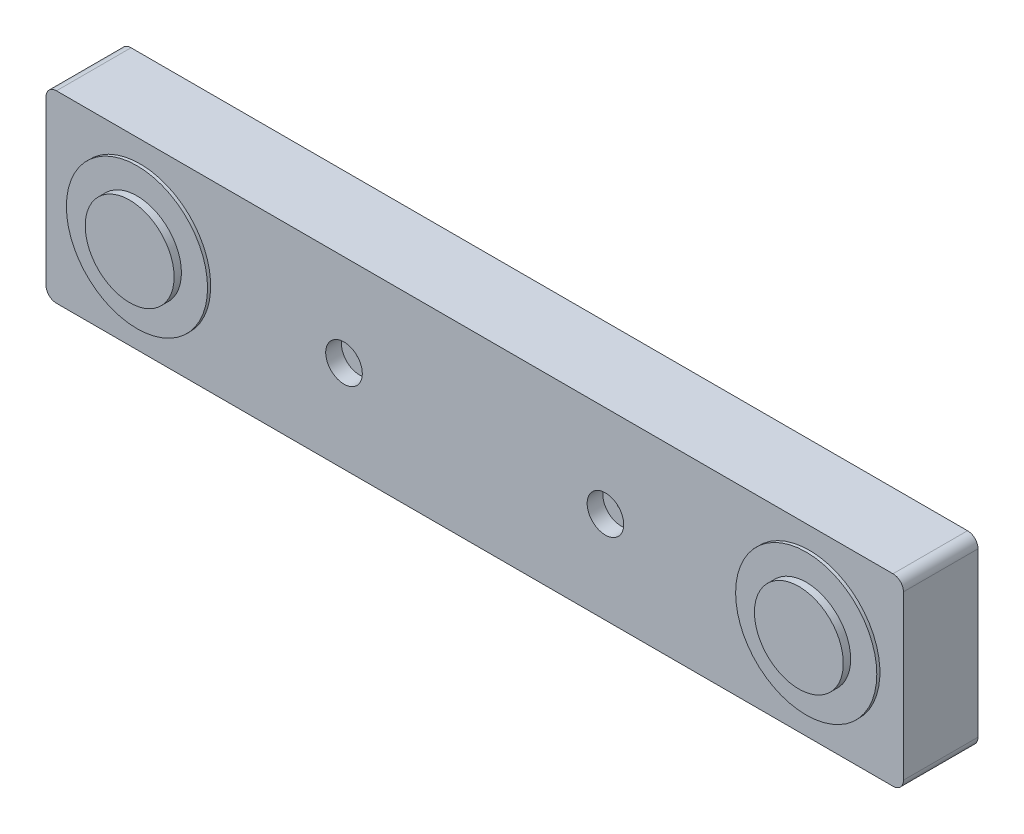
from build123d import *

# Parameters (mm, degrees)
SKETCH2_W               = 82
SKETCH2_H               = 17.6
BOSS_EXTRUDE1_DEPTH     = 7.13
FILLET1_R               = 1
CUT_EXTRUDE1_DEPTH      = 96.261846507
CUT_EXTRUDE1_DEPTH_BACK = 96.261846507
SKETCH4_R               = 0.4
SKETCH5_R               = 1.75
CUT_EXTRUDE2_DEPTH      = 1.5
SKETCH6_R               = 4.25
BOSS_EXTRUDE3_DEPTH     = 1
SKETCH7_R               = 6.75
BOSS_EXTRUDE4_DEPTH     = 0.3


with BuildPart() as part:
    # Sketch2 → Boss-Extrude1 (new body)
    with BuildSketch(Plane.XY):
        with Locations((52.35, 8.8)):
            Rectangle(SKETCH2_W, SKETCH2_H)
    extrude(amount=BOSS_EXTRUDE1_DEPTH)

    # Fillet1
    fillet1_edges = [part.edges().sort_by_distance(p)[0] for p in [
        (93.35, 0, 3.565),
        (11.35, 0, 3.565),
        (11.35, 17.6, 3.565),
        (93.35, 17.6, 3.565),
    ]]
    fillet(fillet1_edges, radius=FILLET1_R)

    # Sketch4 → Cut-Extrude1 (cut, two sides: drawn at the far end of the back side and taken through both)
    with BuildSketch(Plane.XY.offset(7.13).offset(-CUT_EXTRUDE1_DEPTH_BACK)):
        with Locations((39.85, 8.8)):
            Circle(SKETCH4_R)
        with Locations(Location((64.85, 8.8, 0), (0, 0, 180))):
            Circle(SKETCH4_R)
    extrude(amount=CUT_EXTRUDE1_DEPTH + CUT_EXTRUDE1_DEPTH_BACK, mode=Mode.SUBTRACT)

    # Sketch5 → Cut-Extrude2 (cut)
    with BuildSketch(Plane.XY.offset(7.13)):
        with Locations((39.85, 8.8)):
            Circle(SKETCH5_R)
        with Locations((64.85, 8.8)):
            Circle(SKETCH5_R)
    extrude(amount=-CUT_EXTRUDE2_DEPTH, mode=Mode.SUBTRACT)

    # Sketch6 → Boss-Extrude3 (add)
    with BuildSketch(Plane.XY.offset(7.13)):
        with Locations(Location((20.35, 8.8, 0), (0, 0, 180))):
            Circle(SKETCH6_R)
        with Locations(Location((84.35, 8.8, 0), (0, 0, 180))):
            Circle(SKETCH6_R)
    extrude(amount=BOSS_EXTRUDE3_DEPTH)

    # Sketch7 → Boss-Extrude4 (add)
    with BuildSketch(Plane.XY.offset(7.13)):
        with Locations(Location((20.35, 8.8, 0), (0, 0, 180))):
            Circle(SKETCH7_R)
        with Locations(Location((84.35, 8.8, 0), (0, 0, 180))):
            Circle(SKETCH7_R)
    extrude(amount=BOSS_EXTRUDE4_DEPTH)


solid = part.part
